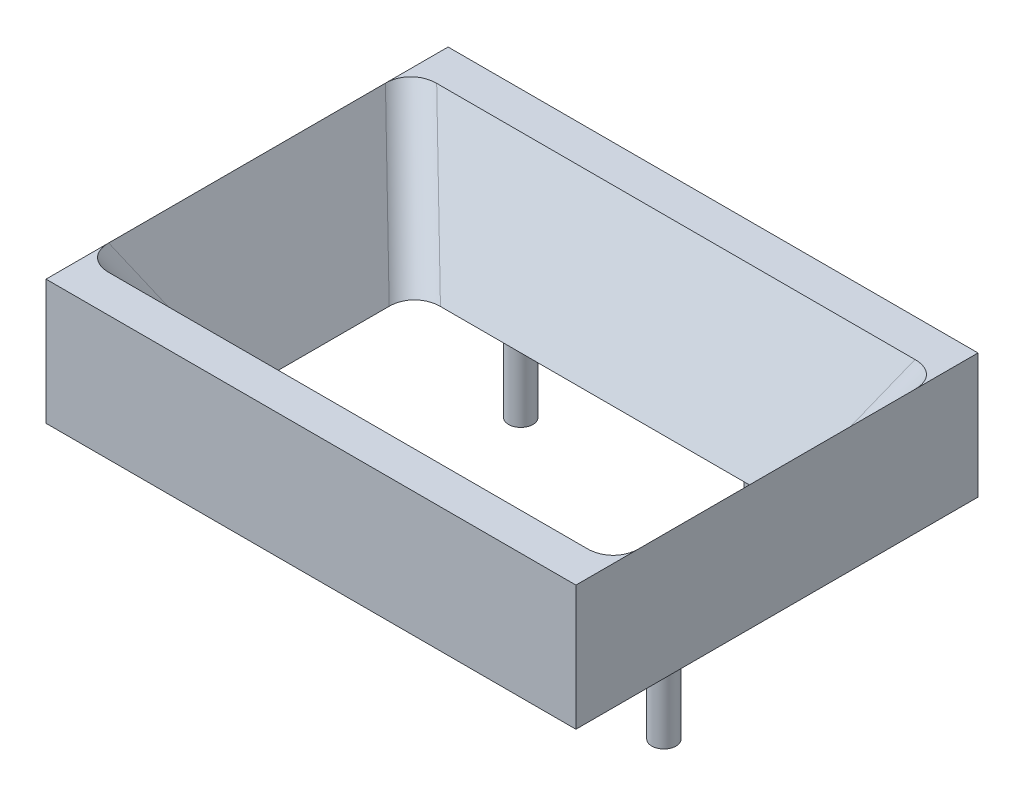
ISO-10303-21;
HEADER;
FILE_DESCRIPTION(('STEP AP214'),'2;1');
FILE_NAME('part.step','',(''),(''),'','','');
FILE_SCHEMA(('AUTOMOTIVE_DESIGN { 1 0 10303 214 1 1 1 1 }'));
ENDSEC;
DATA;
#1=APPLICATION_CONTEXT('core data for automotive mechanical design processes');
#2=APPLICATION_PROTOCOL_DEFINITION('international standard','automotive_design',2000,#1);
#3=PRODUCT_CONTEXT('',#1,'mechanical');
#4=PRODUCT('Part','Part','',(#3));
#5=PRODUCT_RELATED_PRODUCT_CATEGORY('part','',(#4));
#6=PRODUCT_DEFINITION_FORMATION('','',#4);
#7=PRODUCT_DEFINITION_CONTEXT('part definition',#1,'design');
#8=PRODUCT_DEFINITION('design','',#6,#7);
#9=PRODUCT_DEFINITION_SHAPE('','',#8);
#10=(LENGTH_UNIT() NAMED_UNIT(*) SI_UNIT(.MILLI.,.METRE.));
#11=(NAMED_UNIT(*) PLANE_ANGLE_UNIT() SI_UNIT($,.RADIAN.));
#12=(NAMED_UNIT(*) SI_UNIT($,.STERADIAN.) SOLID_ANGLE_UNIT());
#13=UNCERTAINTY_MEASURE_WITH_UNIT(LENGTH_MEASURE(1.E-05),#10,'distance_accuracy_value','');
#14=(GEOMETRIC_REPRESENTATION_CONTEXT(3) GLOBAL_UNCERTAINTY_ASSIGNED_CONTEXT((#13)) GLOBAL_UNIT_ASSIGNED_CONTEXT((#10,
#11,#12)) REPRESENTATION_CONTEXT('',''));
#15=CARTESIAN_POINT('',(0.,0.,0.));
#16=DIRECTION('',(0.,0.,1.));
#17=DIRECTION('',(1.,0.,0.));
#18=AXIS2_PLACEMENT_3D('',#15,#16,#17);
#19=CARTESIAN_POINT('',(69.1261,50.8,52.451));
#20=DIRECTION('',(-1.,0.,0.));
#21=DIRECTION('',(0.,0.,1.));
#22=AXIS2_PLACEMENT_3D('',#19,#20,#21);
#23=PLANE('',#22);
#24=DIRECTION('',(0.,-1.,0.));
#25=VECTOR('',#24,1.);
#26=CARTESIAN_POINT('',(69.1261,50.8,-52.451));
#27=LINE('',#26,#25);
#28=CARTESIAN_POINT('',(69.1261,32.5797333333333,-52.451));
#29=VERTEX_POINT('',#28);
#30=CARTESIAN_POINT('',(69.1261,0.,-52.451));
#31=VERTEX_POINT('',#30);
#32=EDGE_CURVE('E45',#29,#31,#27,.T.);
#33=ORIENTED_EDGE('',*,*,#32,.F.);
#34=DIRECTION('',(0.,0.,-1.));
#35=VECTOR('',#34,1.);
#36=CARTESIAN_POINT('',(69.1261,32.5797333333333,52.451));
#37=LINE('',#36,#35);
#38=CARTESIAN_POINT('',(69.1261,32.5797333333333,-36.1050029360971));
#39=VERTEX_POINT('',#38);
#40=EDGE_CURVE('E151',#39,#29,#37,.T.);
#41=ORIENTED_EDGE('',*,*,#40,.F.);
#42=DIRECTION('',(0.,0.,1.));
#43=VECTOR('',#42,1.);
#44=CARTESIAN_POINT('',(69.1261,32.5797333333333,52.451));
#45=LINE('',#44,#43);
#46=CARTESIAN_POINT('',(69.1261,32.5797333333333,36.1050029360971));
#47=VERTEX_POINT('',#46);
#48=EDGE_CURVE('E150',#39,#47,#45,.T.);
#49=ORIENTED_EDGE('',*,*,#48,.T.);
#50=CARTESIAN_POINT('',(69.1261,32.5797333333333,52.451));
#51=VERTEX_POINT('',#50);
#52=EDGE_CURVE('E133',#51,#47,#37,.T.);
#53=ORIENTED_EDGE('',*,*,#52,.F.);
#54=DIRECTION('',(0.,-1.,0.));
#55=VECTOR('',#54,1.);
#56=CARTESIAN_POINT('',(69.1261,50.8,52.451));
#57=LINE('',#56,#55);
#58=CARTESIAN_POINT('',(69.1261,0.,52.451));
#59=VERTEX_POINT('',#58);
#60=EDGE_CURVE('E146',#51,#59,#57,.T.);
#61=ORIENTED_EDGE('',*,*,#60,.T.);
#62=DIRECTION('',(0.,0.,-1.));
#63=VECTOR('',#62,1.);
#64=CARTESIAN_POINT('',(69.1261,0.,52.451));
#65=LINE('',#64,#63);
#66=EDGE_CURVE('E189',#59,#31,#65,.T.);
#67=ORIENTED_EDGE('',*,*,#66,.T.);
#68=EDGE_LOOP('',(#33,#41,#49,#53,#61,#67));
#69=FACE_BOUND('',#68,.T.);
#70=ADVANCED_FACE('F42',(#69),#23,.F.);
#71=CARTESIAN_POINT('',(-69.1261,50.8,-52.451));
#72=DIRECTION('',(0.,0.,1.));
#73=DIRECTION('',(1.,0.,0.));
#74=AXIS2_PLACEMENT_3D('',#71,#72,#73);
#75=PLANE('',#74);
#76=DIRECTION('',(0.,-1.,0.));
#77=VECTOR('',#76,1.);
#78=CARTESIAN_POINT('',(-69.1261,50.8,-52.451));
#79=LINE('',#78,#77);
#80=CARTESIAN_POINT('',(-69.1261,32.5797333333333,-52.451));
#81=VERTEX_POINT('',#80);
#82=CARTESIAN_POINT('',(-69.1261,0.,-52.451));
#83=VERTEX_POINT('',#82);
#84=EDGE_CURVE('E159',#81,#83,#79,.T.);
#85=ORIENTED_EDGE('',*,*,#84,.F.);
#86=DIRECTION('',(1.,0.,0.));
#87=VECTOR('',#86,1.);
#88=CARTESIAN_POINT('',(-69.1262000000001,32.5797333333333,-52.451));
#89=LINE('',#88,#87);
#90=EDGE_CURVE('E140',#81,#29,#89,.T.);
#91=ORIENTED_EDGE('',*,*,#90,.T.);
#92=ORIENTED_EDGE('',*,*,#32,.T.);
#93=DIRECTION('',(-1.,0.,0.));
#94=VECTOR('',#93,1.);
#95=CARTESIAN_POINT('',(-69.1261,0.,-52.451));
#96=LINE('',#95,#94);
#97=EDGE_CURVE('E185',#31,#83,#96,.T.);
#98=ORIENTED_EDGE('',*,*,#97,.T.);
#99=EDGE_LOOP('',(#85,#91,#92,#98));
#100=FACE_BOUND('',#99,.T.);
#101=ADVANCED_FACE('F184',(#100),#75,.F.);
#102=CARTESIAN_POINT('',(-69.1261,50.8,52.451));
#103=DIRECTION('',(1.,0.,0.));
#104=DIRECTION('',(0.,0.,-1.));
#105=AXIS2_PLACEMENT_3D('',#102,#103,#104);
#106=PLANE('',#105);
#107=DIRECTION('',(0.,-1.,0.));
#108=VECTOR('',#107,1.);
#109=CARTESIAN_POINT('',(-69.1261,50.8,52.451));
#110=LINE('',#109,#108);
#111=CARTESIAN_POINT('',(-69.1261,32.5797333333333,52.451));
#112=VERTEX_POINT('',#111);
#113=CARTESIAN_POINT('',(-69.1261,0.,52.451));
#114=VERTEX_POINT('',#113);
#115=EDGE_CURVE('E157',#112,#114,#110,.T.);
#116=ORIENTED_EDGE('',*,*,#115,.F.);
#117=DIRECTION('',(0.,0.,-1.));
#118=VECTOR('',#117,1.);
#119=CARTESIAN_POINT('',(-69.1261,32.5797333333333,52.451));
#120=LINE('',#119,#118);
#121=CARTESIAN_POINT('',(-69.1261,32.5797333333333,36.1050029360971));
#122=VERTEX_POINT('',#121);
#123=EDGE_CURVE('E136',#112,#122,#120,.T.);
#124=ORIENTED_EDGE('',*,*,#123,.T.);
#125=DIRECTION('',(0.,0.,-1.));
#126=VECTOR('',#125,1.);
#127=CARTESIAN_POINT('',(-69.1261,32.5797333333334,52.451));
#128=LINE('',#127,#126);
#129=CARTESIAN_POINT('',(-69.1261,32.5797333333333,-36.1050029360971));
#130=VERTEX_POINT('',#129);
#131=EDGE_CURVE('E192',#122,#130,#128,.T.);
#132=ORIENTED_EDGE('',*,*,#131,.T.);
#133=EDGE_CURVE('E380',#130,#81,#120,.T.);
#134=ORIENTED_EDGE('',*,*,#133,.T.);
#135=ORIENTED_EDGE('',*,*,#84,.T.);
#136=DIRECTION('',(0.,0.,1.));
#137=VECTOR('',#136,1.);
#138=CARTESIAN_POINT('',(-69.1261,0.,52.451));
#139=LINE('',#138,#137);
#140=EDGE_CURVE('E161',#83,#114,#139,.T.);
#141=ORIENTED_EDGE('',*,*,#140,.T.);
#142=EDGE_LOOP('',(#116,#124,#132,#134,#135,#141));
#143=FACE_BOUND('',#142,.T.);
#144=ADVANCED_FACE('F379',(#143),#106,.F.);
#145=CARTESIAN_POINT('',(-69.1261,50.8,52.451));
#146=DIRECTION('',(0.,0.,-1.));
#147=DIRECTION('',(-1.,0.,0.));
#148=AXIS2_PLACEMENT_3D('',#145,#146,#147);
#149=PLANE('',#148);
#150=ORIENTED_EDGE('',*,*,#60,.F.);
#151=DIRECTION('',(1.,0.,0.));
#152=VECTOR('',#151,1.);
#153=CARTESIAN_POINT('',(-69.1262000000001,32.5797333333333,52.451));
#154=LINE('',#153,#152);
#155=EDGE_CURVE('E130',#112,#51,#154,.T.);
#156=ORIENTED_EDGE('',*,*,#155,.F.);
#157=ORIENTED_EDGE('',*,*,#115,.T.);
#158=DIRECTION('',(1.,0.,0.));
#159=VECTOR('',#158,1.);
#160=CARTESIAN_POINT('',(-69.1261,0.,52.451));
#161=LINE('',#160,#159);
#162=EDGE_CURVE('E155',#114,#59,#161,.T.);
#163=ORIENTED_EDGE('',*,*,#162,.T.);
#164=EDGE_LOOP('',(#150,#156,#157,#163));
#165=FACE_BOUND('',#164,.T.);
#166=ADVANCED_FACE('F153',(#165),#149,.F.);
#167=CARTESIAN_POINT('',(0.,0.,0.));
#168=DIRECTION('',(0.,-1.,0.));
#169=DIRECTION('',(0.,0.,-1.));
#170=AXIS2_PLACEMENT_3D('',#167,#168,#169);
#171=PLANE('',#170);
#172=CARTESIAN_POINT('',(-59.9630499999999,0.,20.33));
#173=DIRECTION('',(0.,-1.,0.));
#174=DIRECTION('',(0.,0.,-1.));
#175=AXIS2_PLACEMENT_3D('',#172,#173,#174);
#176=CIRCLE('',#175,3.17499999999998);
#177=CARTESIAN_POINT('',(-59.9630499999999,0.,17.155));
#178=VERTEX_POINT('',#177);
#179=EDGE_CURVE('E262',#178,#178,#176,.T.);
#180=ORIENTED_EDGE('',*,*,#179,.F.);
#181=EDGE_LOOP('',(#180));
#182=FACE_BOUND('',#181,.T.);
#183=CARTESIAN_POINT('',(59.9630500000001,0.,20.3299999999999));
#184=DIRECTION('',(0.,-1.,0.));
#185=DIRECTION('',(0.,0.,-1.));
#186=AXIS2_PLACEMENT_3D('',#183,#184,#185);
#187=CIRCLE('',#186,3.17499999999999);
#188=CARTESIAN_POINT('',(59.9630500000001,0.,17.155));
#189=VERTEX_POINT('',#188);
#190=EDGE_CURVE('E267',#189,#189,#187,.T.);
#191=ORIENTED_EDGE('',*,*,#190,.F.);
#192=EDGE_LOOP('',(#191));
#193=FACE_BOUND('',#192,.T.);
#194=CARTESIAN_POINT('',(31.3718160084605,0.,-33.655));
#195=DIRECTION('',(0.,-1.,0.));
#196=DIRECTION('',(0.,0.,-1.));
#197=AXIS2_PLACEMENT_3D('',#194,#195,#196);
#198=CIRCLE('',#197,3.17499999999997);
#199=CARTESIAN_POINT('',(31.3718160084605,0.,-36.83));
#200=VERTEX_POINT('',#199);
#201=EDGE_CURVE('E274',#200,#200,#198,.T.);
#202=ORIENTED_EDGE('',*,*,#201,.F.);
#203=EDGE_LOOP('',(#202));
#204=FACE_BOUND('',#203,.T.);
#205=CARTESIAN_POINT('',(-31.3718160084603,0.,-33.655));
#206=DIRECTION('',(0.,-1.,0.));
#207=DIRECTION('',(0.,0.,-1.));
#208=AXIS2_PLACEMENT_3D('',#205,#206,#207);
#209=CIRCLE('',#208,3.17499999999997);
#210=CARTESIAN_POINT('',(-31.3718160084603,0.,-36.83));
#211=VERTEX_POINT('',#210);
#212=EDGE_CURVE('E280',#211,#211,#209,.T.);
#213=ORIENTED_EDGE('',*,*,#212,.F.);
#214=EDGE_LOOP('',(#213));
#215=FACE_BOUND('',#214,.T.);
#216=CARTESIAN_POINT('',(-50.8,0.,-18.7562949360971));
#217=DIRECTION('',(0.,0.,1.));
#218=VECTOR('',#217,1.);
#219=LINE('',#216,#218);
#220=CARTESIAN_POINT('',(-50.8,0.,-18.7562949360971));
#221=VERTEX_POINT('',#220);
#222=CARTESIAN_POINT('',(-50.8,0.,18.7562949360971));
#223=VERTEX_POINT('',#222);
#224=EDGE_CURVE('E252',#221,#223,#219,.T.);
#225=ORIENTED_EDGE('',*,*,#224,.T.);
#226=CARTESIAN_POINT('',(-42.0572121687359,0.,16.7669864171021));
#227=DIRECTION('',(0.,1.,0.));
#228=DIRECTION('',(0.726207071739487,0.,-0.687476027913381));
#229=AXIS2_PLACEMENT_3D('',#226,#227,#228);
#230=ELLIPSE('',#229,9.63850935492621,7.62);
#231=CARTESIAN_POINT('',(-44.0718160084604,0.,25.4));
#232=VERTEX_POINT('',#231);
#233=EDGE_CURVE('E253',#232,#223,#230,.F.);
#234=ORIENTED_EDGE('',*,*,#233,.F.);
#235=CARTESIAN_POINT('',(-44.0718160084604,0.,25.4));
#236=DIRECTION('',(1.,0.,0.));
#237=VECTOR('',#236,1.);
#238=LINE('',#235,#237);
#239=CARTESIAN_POINT('',(44.0718160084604,0.,25.4));
#240=VERTEX_POINT('',#239);
#241=EDGE_CURVE('E259',#232,#240,#238,.T.);
#242=ORIENTED_EDGE('',*,*,#241,.T.);
#243=CARTESIAN_POINT('',(42.0572121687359,0.,16.7669864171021));
#244=DIRECTION('',(0.,1.,0.));
#245=DIRECTION('',(-0.726207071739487,0.,-0.687476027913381));
#246=AXIS2_PLACEMENT_3D('',#243,#244,#245);
#247=ELLIPSE('',#246,9.63850935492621,7.62);
#248=CARTESIAN_POINT('',(50.8,0.,18.7562949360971));
#249=VERTEX_POINT('',#248);
#250=EDGE_CURVE('E342',#249,#240,#247,.F.);
#251=ORIENTED_EDGE('',*,*,#250,.F.);
#252=CARTESIAN_POINT('',(50.8,0.,18.7562949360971));
#253=DIRECTION('',(0.,0.,-1.));
#254=VECTOR('',#253,1.);
#255=LINE('',#252,#254);
#256=CARTESIAN_POINT('',(50.8,0.,-18.7562949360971));
#257=VERTEX_POINT('',#256);
#258=EDGE_CURVE('E203',#249,#257,#255,.T.);
#259=ORIENTED_EDGE('',*,*,#258,.T.);
#260=CARTESIAN_POINT('',(42.0572121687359,0.,-16.7669864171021));
#261=DIRECTION('',(0.,1.,0.));
#262=DIRECTION('',(-0.726207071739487,0.,0.687476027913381));
#263=AXIS2_PLACEMENT_3D('',#260,#261,#262);
#264=ELLIPSE('',#263,9.6385093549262,7.62);
#265=CARTESIAN_POINT('',(44.0718160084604,0.,-25.4));
#266=VERTEX_POINT('',#265);
#267=EDGE_CURVE('E340',#266,#257,#264,.F.);
#268=ORIENTED_EDGE('',*,*,#267,.F.);
#269=CARTESIAN_POINT('',(44.0718160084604,0.,-25.4));
#270=DIRECTION('',(-1.,0.,0.));
#271=VECTOR('',#270,1.);
#272=LINE('',#269,#271);
#273=CARTESIAN_POINT('',(-44.0718160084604,0.,-25.4));
#274=VERTEX_POINT('',#273);
#275=EDGE_CURVE('E241',#266,#274,#272,.T.);
#276=ORIENTED_EDGE('',*,*,#275,.T.);
#277=CARTESIAN_POINT('',(-42.0572121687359,0.,-16.7669864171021));
#278=DIRECTION('',(0.,1.,0.));
#279=DIRECTION('',(0.726207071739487,0.,0.687476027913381));
#280=AXIS2_PLACEMENT_3D('',#277,#278,#279);
#281=ELLIPSE('',#280,9.6385093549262,7.62);
#282=EDGE_CURVE('E254',#221,#274,#281,.F.);
#283=ORIENTED_EDGE('',*,*,#282,.F.);
#284=EDGE_LOOP('',(#225,#234,#242,#251,#259,#268,#276,#283));
#285=FACE_BOUND('',#284,.T.);
#286=ORIENTED_EDGE('',*,*,#66,.F.);
#287=ORIENTED_EDGE('',*,*,#162,.F.);
#288=ORIENTED_EDGE('',*,*,#140,.F.);
#289=ORIENTED_EDGE('',*,*,#97,.F.);
#290=EDGE_LOOP('',(#286,#287,#288,#289));
#291=FACE_BOUND('',#290,.T.);
#292=ADVANCED_FACE('F188',(#182,#193,#204,#215,#285,#291),#171,.T.);
#293=CARTESIAN_POINT('',(38.5899109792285,-21.706824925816,0.));
#294=DIRECTION('',(0.871575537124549,-0.490261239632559,0.));
#295=DIRECTION('',(-0.490261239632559,-0.871575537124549,0.));
#296=AXIS2_PLACEMENT_3D('',#293,#294,#295);
#297=PLANE('',#296);
#298=DIRECTION('',(-0.444700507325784,-0.790578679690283,0.420983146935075));
#299=VECTOR('',#298,1.);
#300=CARTESIAN_POINT('',(37.2424735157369,-24.1022693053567,-5.92183653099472));
#301=LINE('',#300,#299);
#302=EDGE_CURVE('E367',#257,#39,#301,.F.);
#303=ORIENTED_EDGE('',*,*,#302,.F.);
#304=ORIENTED_EDGE('',*,*,#258,.F.);
#305=DIRECTION('',(-0.444700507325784,-0.790578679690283,-0.420983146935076));
#306=VECTOR('',#305,1.);
#307=CARTESIAN_POINT('',(37.2424735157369,-24.1022693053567,5.9218365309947));
#308=LINE('',#307,#306);
#309=EDGE_CURVE('E370',#47,#249,#308,.T.);
#310=ORIENTED_EDGE('',*,*,#309,.F.);
#311=ORIENTED_EDGE('',*,*,#48,.F.);
#312=EDGE_LOOP('',(#303,#304,#310,#311));
#313=FACE_BOUND('',#312,.T.);
#314=ADVANCED_FACE('F219',(#313),#297,.F.);
#315=CARTESIAN_POINT('',(0.,-10.5375202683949,-19.7887704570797));
#316=DIRECTION('',(0.,-0.470015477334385,-0.882658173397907));
#317=DIRECTION('',(0.,-0.882658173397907,0.470015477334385));
#318=AXIS2_PLACEMENT_3D('',#315,#316,#317);
#319=PLANE('',#318);
#320=DIRECTION('',(-0.444700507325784,-0.790578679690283,0.420983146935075));
#321=VECTOR('',#320,1.);
#322=CARTESIAN_POINT('',(30.6010679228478,-23.9479965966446,-12.6476918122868));
#323=LINE('',#322,#321);
#324=CARTESIAN_POINT('',(62.3979160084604,32.5797333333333,-42.748708));
#325=VERTEX_POINT('',#324);
#326=EDGE_CURVE('E64',#325,#266,#323,.T.);
#327=ORIENTED_EDGE('',*,*,#326,.F.);
#328=DIRECTION('',(-1.,0.,0.));
#329=VECTOR('',#328,1.);
#330=CARTESIAN_POINT('',(0.,32.5797333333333,-42.748708));
#331=LINE('',#330,#329);
#332=CARTESIAN_POINT('',(-62.3979160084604,32.5797333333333,-42.748708));
#333=VERTEX_POINT('',#332);
#334=EDGE_CURVE('E58',#325,#333,#331,.T.);
#335=ORIENTED_EDGE('',*,*,#334,.T.);
#336=DIRECTION('',(0.444700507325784,-0.790578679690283,0.420983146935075));
#337=VECTOR('',#336,1.);
#338=CARTESIAN_POINT('',(-30.6010679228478,-23.9479965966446,-12.6476918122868));
#339=LINE('',#338,#337);
#340=EDGE_CURVE('E356',#274,#333,#339,.F.);
#341=ORIENTED_EDGE('',*,*,#340,.F.);
#342=ORIENTED_EDGE('',*,*,#275,.F.);
#343=EDGE_LOOP('',(#327,#335,#341,#342));
#344=FACE_BOUND('',#343,.T.);
#345=ADVANCED_FACE('F306',(#344),#319,.F.);
#346=CARTESIAN_POINT('',(0.,-10.5375202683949,19.7887704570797));
#347=DIRECTION('',(0.,-0.470015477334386,0.882658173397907));
#348=DIRECTION('',(0.,0.882658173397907,0.470015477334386));
#349=AXIS2_PLACEMENT_3D('',#346,#347,#348);
#350=PLANE('',#349);
#351=DIRECTION('',(0.444700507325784,-0.790578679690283,-0.420983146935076));
#352=VECTOR('',#351,1.);
#353=CARTESIAN_POINT('',(-30.6010679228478,-23.9479965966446,12.6476918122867));
#354=LINE('',#353,#352);
#355=CARTESIAN_POINT('',(-62.3979160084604,32.5797333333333,42.748708));
#356=VERTEX_POINT('',#355);
#357=EDGE_CURVE('E165',#356,#232,#354,.T.);
#358=ORIENTED_EDGE('',*,*,#357,.F.);
#359=DIRECTION('',(1.,0.,0.));
#360=VECTOR('',#359,1.);
#361=CARTESIAN_POINT('',(0.,32.5797333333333,42.748708));
#362=LINE('',#361,#360);
#363=CARTESIAN_POINT('',(62.3979160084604,32.5797333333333,42.748708));
#364=VERTEX_POINT('',#363);
#365=EDGE_CURVE('E393',#356,#364,#362,.T.);
#366=ORIENTED_EDGE('',*,*,#365,.T.);
#367=DIRECTION('',(-0.444700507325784,-0.790578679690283,-0.420983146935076));
#368=VECTOR('',#367,1.);
#369=CARTESIAN_POINT('',(30.6010679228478,-23.9479965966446,12.6476918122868));
#370=LINE('',#369,#368);
#371=EDGE_CURVE('E359',#240,#364,#370,.F.);
#372=ORIENTED_EDGE('',*,*,#371,.F.);
#373=ORIENTED_EDGE('',*,*,#241,.F.);
#374=EDGE_LOOP('',(#358,#366,#372,#373));
#375=FACE_BOUND('',#374,.T.);
#376=ADVANCED_FACE('F312',(#375),#350,.F.);
#377=CARTESIAN_POINT('',(-38.5899109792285,-21.706824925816,0.));
#378=DIRECTION('',(-0.871575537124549,-0.490261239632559,0.));
#379=DIRECTION('',(-0.490261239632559,0.871575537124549,0.));
#380=AXIS2_PLACEMENT_3D('',#377,#378,#379);
#381=PLANE('',#380);
#382=DIRECTION('',(0.444700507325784,-0.790578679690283,-0.420983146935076));
#383=VECTOR('',#382,1.);
#384=CARTESIAN_POINT('',(-37.2424735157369,-24.1022693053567,5.9218365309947));
#385=LINE('',#384,#383);
#386=EDGE_CURVE('E376',#223,#122,#385,.F.);
#387=ORIENTED_EDGE('',*,*,#386,.F.);
#388=ORIENTED_EDGE('',*,*,#224,.F.);
#389=DIRECTION('',(0.444700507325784,-0.790578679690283,0.420983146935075));
#390=VECTOR('',#389,1.);
#391=CARTESIAN_POINT('',(-37.2424735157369,-24.1022693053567,-5.9218365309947));
#392=LINE('',#391,#390);
#393=EDGE_CURVE('E343',#130,#221,#392,.T.);
#394=ORIENTED_EDGE('',*,*,#393,.F.);
#395=ORIENTED_EDGE('',*,*,#131,.F.);
#396=EDGE_LOOP('',(#387,#388,#394,#395));
#397=FACE_BOUND('',#396,.T.);
#398=ADVANCED_FACE('F382',(#397),#381,.F.);
#399=CARTESIAN_POINT('',(-30.6010679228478,-20.3664786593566,-5.92183653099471));
#400=DIRECTION('',(0.444700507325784,-0.790578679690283,0.420983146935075));
#401=DIRECTION('',(-0.871575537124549,-0.490261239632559,0.));
#402=AXIS2_PLACEMENT_3D('',#399,#400,#401);
#403=CYLINDRICAL_SURFACE('',#402,7.62);
#404=ORIENTED_EDGE('',*,*,#340,.T.);
#405=CARTESIAN_POINT('',(-60.3833121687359,32.5797333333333,-34.1156944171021));
#406=DIRECTION('',(0.,-1.,0.));
#407=DIRECTION('',(0.726207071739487,0.,0.687476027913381));
#408=AXIS2_PLACEMENT_3D('',#405,#406,#407);
#409=ELLIPSE('',#408,9.6385093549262,7.62);
#410=EDGE_CURVE('E386',#333,#130,#409,.F.);
#411=ORIENTED_EDGE('',*,*,#410,.T.);
#412=ORIENTED_EDGE('',*,*,#393,.T.);
#413=ORIENTED_EDGE('',*,*,#282,.T.);
#414=EDGE_LOOP('',(#404,#411,#412,#413));
#415=FACE_BOUND('',#414,.T.);
#416=ADVANCED_FACE('F385',(#415),#403,.F.);
#417=CARTESIAN_POINT('',(-30.6010679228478,-20.3664786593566,5.9218365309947));
#418=DIRECTION('',(0.444700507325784,-0.790578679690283,-0.420983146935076));
#419=DIRECTION('',(-0.871575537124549,-0.490261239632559,0.));
#420=AXIS2_PLACEMENT_3D('',#417,#418,#419);
#421=CYLINDRICAL_SURFACE('',#420,7.62);
#422=ORIENTED_EDGE('',*,*,#386,.T.);
#423=CARTESIAN_POINT('',(-60.3833121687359,32.5797333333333,34.1156944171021));
#424=DIRECTION('',(0.,-1.,0.));
#425=DIRECTION('',(0.726207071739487,0.,-0.687476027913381));
#426=AXIS2_PLACEMENT_3D('',#423,#424,#425);
#427=ELLIPSE('',#426,9.63850935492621,7.62);
#428=EDGE_CURVE('E395',#122,#356,#427,.F.);
#429=ORIENTED_EDGE('',*,*,#428,.T.);
#430=ORIENTED_EDGE('',*,*,#357,.T.);
#431=ORIENTED_EDGE('',*,*,#233,.T.);
#432=EDGE_LOOP('',(#422,#429,#430,#431));
#433=FACE_BOUND('',#432,.T.);
#434=ADVANCED_FACE('F398',(#433),#421,.F.);
#435=CARTESIAN_POINT('',(30.6010679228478,-20.3664786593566,5.9218365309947));
#436=DIRECTION('',(-0.444700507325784,-0.790578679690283,-0.420983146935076));
#437=DIRECTION('',(-0.871575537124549,0.490261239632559,0.));
#438=AXIS2_PLACEMENT_3D('',#435,#436,#437);
#439=CYLINDRICAL_SURFACE('',#438,7.62);
#440=ORIENTED_EDGE('',*,*,#371,.T.);
#441=CARTESIAN_POINT('',(60.3833121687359,32.5797333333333,34.1156944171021));
#442=DIRECTION('',(0.,-1.,0.));
#443=DIRECTION('',(-0.726207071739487,0.,-0.687476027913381));
#444=AXIS2_PLACEMENT_3D('',#441,#442,#443);
#445=ELLIPSE('',#444,9.63850935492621,7.62);
#446=EDGE_CURVE('E388',#364,#47,#445,.F.);
#447=ORIENTED_EDGE('',*,*,#446,.T.);
#448=ORIENTED_EDGE('',*,*,#309,.T.);
#449=ORIENTED_EDGE('',*,*,#250,.T.);
#450=EDGE_LOOP('',(#440,#447,#448,#449));
#451=FACE_BOUND('',#450,.T.);
#452=ADVANCED_FACE('F400',(#451),#439,.F.);
#453=CARTESIAN_POINT('',(30.6010679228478,-20.3664786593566,-5.92183653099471));
#454=DIRECTION('',(-0.444700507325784,-0.790578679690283,0.420983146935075));
#455=DIRECTION('',(-0.871575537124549,0.490261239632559,0.));
#456=AXIS2_PLACEMENT_3D('',#453,#454,#455);
#457=CYLINDRICAL_SURFACE('',#456,7.62);
#458=ORIENTED_EDGE('',*,*,#302,.T.);
#459=CARTESIAN_POINT('',(60.3833121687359,32.5797333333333,-34.1156944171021));
#460=DIRECTION('',(0.,-1.,0.));
#461=DIRECTION('',(-0.726207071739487,0.,0.687476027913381));
#462=AXIS2_PLACEMENT_3D('',#459,#460,#461);
#463=ELLIPSE('',#462,9.6385093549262,7.62);
#464=EDGE_CURVE('E12',#39,#325,#463,.F.);
#465=ORIENTED_EDGE('',*,*,#464,.T.);
#466=ORIENTED_EDGE('',*,*,#326,.T.);
#467=ORIENTED_EDGE('',*,*,#267,.T.);
#468=EDGE_LOOP('',(#458,#465,#466,#467));
#469=FACE_BOUND('',#468,.T.);
#470=ADVANCED_FACE('F221',(#469),#457,.F.);
#471=CARTESIAN_POINT('',(-31.3718160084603,-34.3802561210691,-33.655));
#472=DIRECTION('',(0.,1.,0.));
#473=DIRECTION('',(0.,0.,1.));
#474=AXIS2_PLACEMENT_3D('',#471,#472,#473);
#475=CYLINDRICAL_SURFACE('',#474,3.17499999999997);
#476=CARTESIAN_POINT('',(-31.3718160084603,-22.86,-33.655));
#477=DIRECTION('',(0.,1.,0.));
#478=DIRECTION('',(0.,0.,1.));
#479=AXIS2_PLACEMENT_3D('',#476,#477,#478);
#480=CIRCLE('',#479,3.17499999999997);
#481=CARTESIAN_POINT('',(-31.3718160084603,-22.86,-30.48));
#482=VERTEX_POINT('',#481);
#483=EDGE_CURVE('E283',#482,#482,#480,.T.);
#484=ORIENTED_EDGE('',*,*,#483,.T.);
#485=EDGE_LOOP('',(#484));
#486=FACE_BOUND('',#485,.T.);
#487=ORIENTED_EDGE('',*,*,#212,.T.);
#488=EDGE_LOOP('',(#487));
#489=FACE_BOUND('',#488,.T.);
#490=ADVANCED_FACE('F478',(#486,#489),#475,.T.);
#491=CARTESIAN_POINT('',(0.,-22.86,0.));
#492=DIRECTION('',(0.,1.,0.));
#493=DIRECTION('',(1.,0.,0.));
#494=AXIS2_PLACEMENT_3D('',#491,#492,#493);
#495=PLANE('',#494);
#496=ORIENTED_EDGE('',*,*,#483,.F.);
#497=EDGE_LOOP('',(#496));
#498=FACE_BOUND('',#497,.T.);
#499=ADVANCED_FACE('F308',(#498),#495,.F.);
#500=CARTESIAN_POINT('',(31.3718160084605,-34.3802561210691,-33.655));
#501=DIRECTION('',(0.,1.,0.));
#502=DIRECTION('',(0.,0.,1.));
#503=AXIS2_PLACEMENT_3D('',#500,#501,#502);
#504=CYLINDRICAL_SURFACE('',#503,3.17499999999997);
#505=CARTESIAN_POINT('',(31.3718160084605,-22.86,-33.655));
#506=DIRECTION('',(0.,1.,0.));
#507=DIRECTION('',(0.,0.,1.));
#508=AXIS2_PLACEMENT_3D('',#505,#506,#507);
#509=CIRCLE('',#508,3.17499999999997);
#510=CARTESIAN_POINT('',(31.3718160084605,-22.86,-30.48));
#511=VERTEX_POINT('',#510);
#512=EDGE_CURVE('E277',#511,#511,#509,.T.);
#513=ORIENTED_EDGE('',*,*,#512,.T.);
#514=EDGE_LOOP('',(#513));
#515=FACE_BOUND('',#514,.T.);
#516=ORIENTED_EDGE('',*,*,#201,.T.);
#517=EDGE_LOOP('',(#516));
#518=FACE_BOUND('',#517,.T.);
#519=ADVANCED_FACE('F498',(#515,#518),#504,.T.);
#520=CARTESIAN_POINT('',(0.,-22.86,0.));
#521=DIRECTION('',(0.,1.,0.));
#522=DIRECTION('',(1.,0.,0.));
#523=AXIS2_PLACEMENT_3D('',#520,#521,#522);
#524=PLANE('',#523);
#525=ORIENTED_EDGE('',*,*,#512,.F.);
#526=EDGE_LOOP('',(#525));
#527=FACE_BOUND('',#526,.T.);
#528=ADVANCED_FACE('F507',(#527),#524,.F.);
#529=CARTESIAN_POINT('',(59.9630500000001,-34.3802561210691,20.3299999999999));
#530=DIRECTION('',(0.,1.,0.));
#531=DIRECTION('',(0.,0.,1.));
#532=AXIS2_PLACEMENT_3D('',#529,#530,#531);
#533=CYLINDRICAL_SURFACE('',#532,3.17499999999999);
#534=CARTESIAN_POINT('',(59.9630500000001,-22.86,20.3299999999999));
#535=DIRECTION('',(0.,1.,0.));
#536=DIRECTION('',(0.,0.,1.));
#537=AXIS2_PLACEMENT_3D('',#534,#535,#536);
#538=CIRCLE('',#537,3.17499999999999);
#539=CARTESIAN_POINT('',(59.9630500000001,-22.86,23.5049999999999));
#540=VERTEX_POINT('',#539);
#541=EDGE_CURVE('E271',#540,#540,#538,.T.);
#542=ORIENTED_EDGE('',*,*,#541,.T.);
#543=EDGE_LOOP('',(#542));
#544=FACE_BOUND('',#543,.T.);
#545=ORIENTED_EDGE('',*,*,#190,.T.);
#546=EDGE_LOOP('',(#545));
#547=FACE_BOUND('',#546,.T.);
#548=ADVANCED_FACE('F517',(#544,#547),#533,.T.);
#549=CARTESIAN_POINT('',(0.,-22.86,0.));
#550=DIRECTION('',(0.,1.,0.));
#551=DIRECTION('',(1.,0.,0.));
#552=AXIS2_PLACEMENT_3D('',#549,#550,#551);
#553=PLANE('',#552);
#554=ORIENTED_EDGE('',*,*,#541,.F.);
#555=EDGE_LOOP('',(#554));
#556=FACE_BOUND('',#555,.T.);
#557=ADVANCED_FACE('F527',(#556),#553,.F.);
#558=CARTESIAN_POINT('',(-59.9630499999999,-34.3802561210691,20.33));
#559=DIRECTION('',(0.,1.,0.));
#560=DIRECTION('',(0.,0.,1.));
#561=AXIS2_PLACEMENT_3D('',#558,#559,#560);
#562=CYLINDRICAL_SURFACE('',#561,3.17499999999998);
#563=CARTESIAN_POINT('',(-59.9630499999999,-22.86,20.33));
#564=DIRECTION('',(0.,1.,0.));
#565=DIRECTION('',(0.,0.,1.));
#566=AXIS2_PLACEMENT_3D('',#563,#564,#565);
#567=CIRCLE('',#566,3.17499999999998);
#568=CARTESIAN_POINT('',(-59.9630499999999,-22.86,23.505));
#569=VERTEX_POINT('',#568);
#570=EDGE_CURVE('E260',#569,#569,#567,.T.);
#571=ORIENTED_EDGE('',*,*,#570,.T.);
#572=EDGE_LOOP('',(#571));
#573=FACE_BOUND('',#572,.T.);
#574=ORIENTED_EDGE('',*,*,#179,.T.);
#575=EDGE_LOOP('',(#574));
#576=FACE_BOUND('',#575,.T.);
#577=ADVANCED_FACE('F411',(#573,#576),#562,.T.);
#578=CARTESIAN_POINT('',(0.,-22.86,0.));
#579=DIRECTION('',(0.,1.,0.));
#580=DIRECTION('',(1.,0.,0.));
#581=AXIS2_PLACEMENT_3D('',#578,#579,#580);
#582=PLANE('',#581);
#583=ORIENTED_EDGE('',*,*,#570,.F.);
#584=EDGE_LOOP('',(#583));
#585=FACE_BOUND('',#584,.T.);
#586=ADVANCED_FACE('F404',(#585),#582,.F.);
#587=CARTESIAN_POINT('',(-69.1262000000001,32.5797333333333,52.451));
#588=DIRECTION('',(0.,-1.,0.));
#589=DIRECTION('',(0.,0.,-1.));
#590=AXIS2_PLACEMENT_3D('',#587,#588,#589);
#591=PLANE('',#590);
#592=ORIENTED_EDGE('',*,*,#410,.F.);
#593=ORIENTED_EDGE('',*,*,#334,.F.);
#594=ORIENTED_EDGE('',*,*,#464,.F.);
#595=ORIENTED_EDGE('',*,*,#40,.T.);
#596=ORIENTED_EDGE('',*,*,#90,.F.);
#597=ORIENTED_EDGE('',*,*,#133,.F.);
#598=EDGE_LOOP('',(#592,#593,#594,#595,#596,#597));
#599=FACE_BOUND('',#598,.T.);
#600=ADVANCED_FACE('F401',(#599),#591,.F.);
#601=ORIENTED_EDGE('',*,*,#155,.T.);
#602=ORIENTED_EDGE('',*,*,#52,.T.);
#603=ORIENTED_EDGE('',*,*,#446,.F.);
#604=ORIENTED_EDGE('',*,*,#365,.F.);
#605=ORIENTED_EDGE('',*,*,#428,.F.);
#606=ORIENTED_EDGE('',*,*,#123,.F.);
#607=EDGE_LOOP('',(#601,#602,#603,#604,#605,#606));
#608=FACE_BOUND('',#607,.T.);
#609=ADVANCED_FACE('F132',(#608),#591,.F.);
#610=CLOSED_SHELL('',(#70,#101,#144,#166,#292,#314,#345,#376,#398,#416,#434,#452,#470,#490,#499,
#519,#528,#548,#557,#577,#586,#600,#609));
#611=MANIFOLD_SOLID_BREP('B2',#610);
#612=ADVANCED_BREP_SHAPE_REPRESENTATION('',(#18,#611),#14);
#613=SHAPE_DEFINITION_REPRESENTATION(#9,#612);
ENDSEC;
END-ISO-10303-21;
